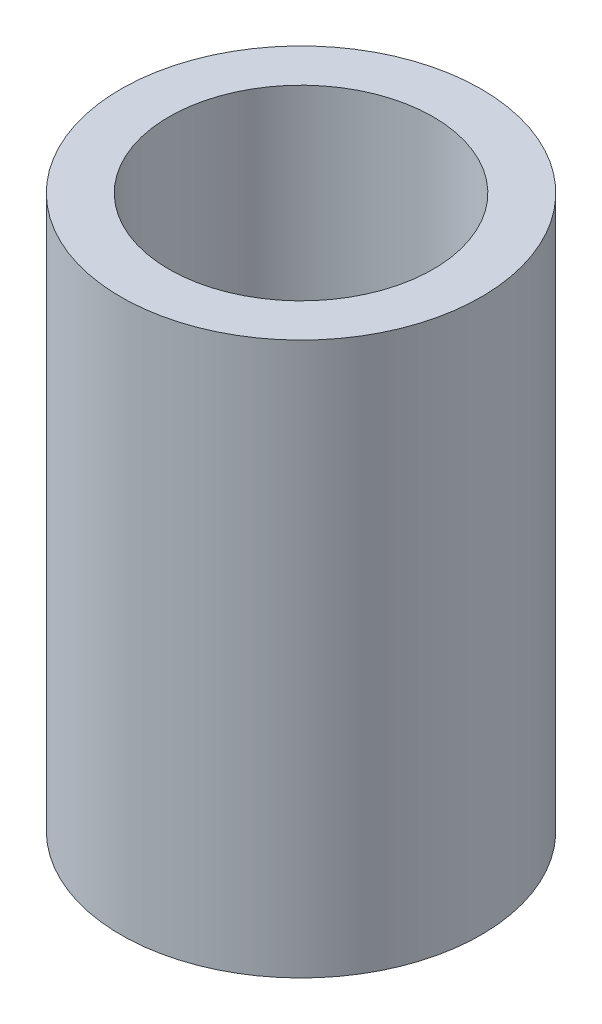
ISO-10303-21;
HEADER;
FILE_DESCRIPTION(('STEP AP214'),'2;1');
FILE_NAME('part.step','',(''),(''),'','','');
FILE_SCHEMA(('AUTOMOTIVE_DESIGN { 1 0 10303 214 1 1 1 1 }'));
ENDSEC;
DATA;
#1=APPLICATION_CONTEXT('core data for automotive mechanical design processes');
#2=APPLICATION_PROTOCOL_DEFINITION('international standard','automotive_design',2000,#1);
#3=PRODUCT_CONTEXT('',#1,'mechanical');
#4=PRODUCT('Part','Part','',(#3));
#5=PRODUCT_RELATED_PRODUCT_CATEGORY('part','',(#4));
#6=PRODUCT_DEFINITION_FORMATION('','',#4);
#7=PRODUCT_DEFINITION_CONTEXT('part definition',#1,'design');
#8=PRODUCT_DEFINITION('design','',#6,#7);
#9=PRODUCT_DEFINITION_SHAPE('','',#8);
#10=(LENGTH_UNIT() NAMED_UNIT(*) SI_UNIT(.MILLI.,.METRE.));
#11=(NAMED_UNIT(*) PLANE_ANGLE_UNIT() SI_UNIT($,.RADIAN.));
#12=(NAMED_UNIT(*) SI_UNIT($,.STERADIAN.) SOLID_ANGLE_UNIT());
#13=UNCERTAINTY_MEASURE_WITH_UNIT(LENGTH_MEASURE(1.E-05),#10,'distance_accuracy_value','');
#14=(GEOMETRIC_REPRESENTATION_CONTEXT(3) GLOBAL_UNCERTAINTY_ASSIGNED_CONTEXT((#13)) GLOBAL_UNIT_ASSIGNED_CONTEXT((#10,
#11,#12)) REPRESENTATION_CONTEXT('',''));
#15=CARTESIAN_POINT('',(0.,0.,0.));
#16=DIRECTION('',(0.,0.,1.));
#17=DIRECTION('',(1.,0.,0.));
#18=AXIS2_PLACEMENT_3D('',#15,#16,#17);
#19=CARTESIAN_POINT('',(0.,11.5,0.));
#20=DIRECTION('',(0.,-1.,0.));
#21=DIRECTION('',(0.,0.,-1.));
#22=AXIS2_PLACEMENT_3D('',#19,#20,#21);
#23=CYLINDRICAL_SURFACE('',#22,2.75);
#24=CARTESIAN_POINT('',(0.,0.,0.));
#25=DIRECTION('',(0.,-1.,0.));
#26=DIRECTION('',(0.,0.,-1.));
#27=AXIS2_PLACEMENT_3D('',#24,#25,#26);
#28=CIRCLE('',#27,2.75);
#29=CARTESIAN_POINT('',(0.,0.,-2.75));
#30=VERTEX_POINT('',#29);
#31=EDGE_CURVE('E27',#30,#30,#28,.T.);
#32=ORIENTED_EDGE('',*,*,#31,.T.);
#33=EDGE_LOOP('',(#32));
#34=FACE_BOUND('',#33,.T.);
#35=CARTESIAN_POINT('',(0.,11.5,0.));
#36=DIRECTION('',(0.,-1.,0.));
#37=DIRECTION('',(0.,0.,-1.));
#38=AXIS2_PLACEMENT_3D('',#35,#36,#37);
#39=CIRCLE('',#38,2.75);
#40=CARTESIAN_POINT('',(0.,11.5,-2.75));
#41=VERTEX_POINT('',#40);
#42=EDGE_CURVE('E18',#41,#41,#39,.T.);
#43=ORIENTED_EDGE('',*,*,#42,.F.);
#44=EDGE_LOOP('',(#43));
#45=FACE_BOUND('',#44,.T.);
#46=ADVANCED_FACE('F15',(#34,#45),#23,.F.);
#47=CARTESIAN_POINT('',(0.,11.5,0.));
#48=DIRECTION('',(0.,1.,0.));
#49=DIRECTION('',(0.,0.,1.));
#50=AXIS2_PLACEMENT_3D('',#47,#48,#49);
#51=PLANE('',#50);
#52=ORIENTED_EDGE('',*,*,#42,.T.);
#53=EDGE_LOOP('',(#52));
#54=FACE_BOUND('',#53,.T.);
#55=CARTESIAN_POINT('',(0.,11.5,0.));
#56=DIRECTION('',(0.,-1.,0.));
#57=DIRECTION('',(0.,0.,-1.));
#58=AXIS2_PLACEMENT_3D('',#55,#56,#57);
#59=CIRCLE('',#58,3.75);
#60=CARTESIAN_POINT('',(0.,11.5,-3.75));
#61=VERTEX_POINT('',#60);
#62=EDGE_CURVE('E22',#61,#61,#59,.T.);
#63=ORIENTED_EDGE('',*,*,#62,.F.);
#64=EDGE_LOOP('',(#63));
#65=FACE_BOUND('',#64,.T.);
#66=ADVANCED_FACE('F35',(#54,#65),#51,.T.);
#67=CARTESIAN_POINT('',(0.,0.,0.));
#68=DIRECTION('',(0.,1.,0.));
#69=DIRECTION('',(0.,0.,1.));
#70=AXIS2_PLACEMENT_3D('',#67,#68,#69);
#71=PLANE('',#70);
#72=ORIENTED_EDGE('',*,*,#31,.F.);
#73=EDGE_LOOP('',(#72));
#74=FACE_BOUND('',#73,.T.);
#75=CARTESIAN_POINT('',(0.,0.,0.));
#76=DIRECTION('',(0.,-1.,0.));
#77=DIRECTION('',(0.,0.,-1.));
#78=AXIS2_PLACEMENT_3D('',#75,#76,#77);
#79=CIRCLE('',#78,3.75);
#80=CARTESIAN_POINT('',(0.,0.,-3.75));
#81=VERTEX_POINT('',#80);
#82=EDGE_CURVE('E10',#81,#81,#79,.F.);
#83=ORIENTED_EDGE('',*,*,#82,.F.);
#84=EDGE_LOOP('',(#83));
#85=FACE_BOUND('',#84,.T.);
#86=ADVANCED_FACE('F43',(#74,#85),#71,.F.);
#87=CARTESIAN_POINT('',(0.,11.5,0.));
#88=DIRECTION('',(0.,-1.,0.));
#89=DIRECTION('',(0.,0.,-1.));
#90=AXIS2_PLACEMENT_3D('',#87,#88,#89);
#91=CYLINDRICAL_SURFACE('',#90,3.75);
#92=ORIENTED_EDGE('',*,*,#82,.T.);
#93=EDGE_LOOP('',(#92));
#94=FACE_BOUND('',#93,.T.);
#95=ORIENTED_EDGE('',*,*,#62,.T.);
#96=EDGE_LOOP('',(#95));
#97=FACE_BOUND('',#96,.T.);
#98=ADVANCED_FACE('F44',(#94,#97),#91,.T.);
#99=CLOSED_SHELL('',(#46,#66,#86,#98));
#100=MANIFOLD_SOLID_BREP('B1',#99);
#101=ADVANCED_BREP_SHAPE_REPRESENTATION('',(#18,#100),#14);
#102=SHAPE_DEFINITION_REPRESENTATION(#9,#101);
ENDSEC;
END-ISO-10303-21;
